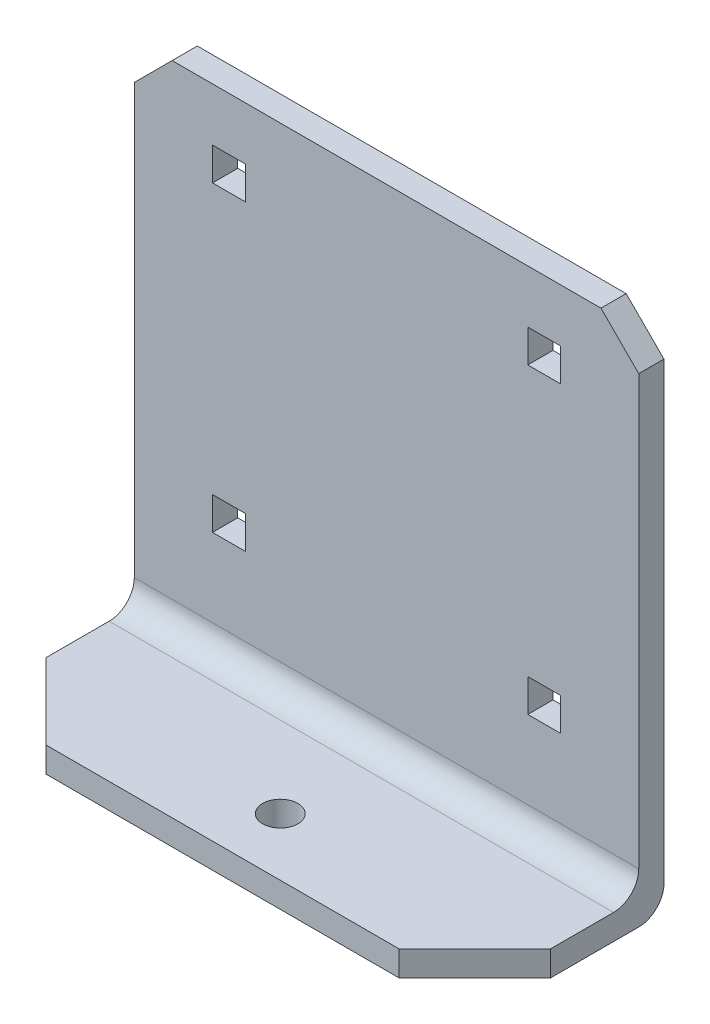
ISO-10303-21;
HEADER;
FILE_DESCRIPTION(('STEP AP214'),'2;1');
FILE_NAME('part.step','',(''),(''),'','','');
FILE_SCHEMA(('AUTOMOTIVE_DESIGN { 1 0 10303 214 1 1 1 1 }'));
ENDSEC;
DATA;
#1=APPLICATION_CONTEXT('core data for automotive mechanical design processes');
#2=APPLICATION_PROTOCOL_DEFINITION('international standard','automotive_design',2000,#1);
#3=PRODUCT_CONTEXT('',#1,'mechanical');
#4=PRODUCT('Part','Part','',(#3));
#5=PRODUCT_RELATED_PRODUCT_CATEGORY('part','',(#4));
#6=PRODUCT_DEFINITION_FORMATION('','',#4);
#7=PRODUCT_DEFINITION_CONTEXT('part definition',#1,'design');
#8=PRODUCT_DEFINITION('design','',#6,#7);
#9=PRODUCT_DEFINITION_SHAPE('','',#8);
#10=(LENGTH_UNIT() NAMED_UNIT(*) SI_UNIT(.MILLI.,.METRE.));
#11=(NAMED_UNIT(*) PLANE_ANGLE_UNIT() SI_UNIT($,.RADIAN.));
#12=(NAMED_UNIT(*) SI_UNIT($,.STERADIAN.) SOLID_ANGLE_UNIT());
#13=UNCERTAINTY_MEASURE_WITH_UNIT(LENGTH_MEASURE(1.E-05),#10,'distance_accuracy_value','');
#14=(GEOMETRIC_REPRESENTATION_CONTEXT(3) GLOBAL_UNCERTAINTY_ASSIGNED_CONTEXT((#13)) GLOBAL_UNIT_ASSIGNED_CONTEXT((#10,
#11,#12)) REPRESENTATION_CONTEXT('',''));
#15=CARTESIAN_POINT('',(0.,0.,0.));
#16=DIRECTION('',(0.,0.,1.));
#17=DIRECTION('',(1.,0.,0.));
#18=AXIS2_PLACEMENT_3D('',#15,#16,#17);
#19=CARTESIAN_POINT('',(100.,-107.5,10.));
#20=DIRECTION('',(0.,0.,1.));
#21=DIRECTION('',(1.,0.,0.));
#22=AXIS2_PLACEMENT_3D('',#19,#20,#21);
#23=PLANE('',#22);
#24=DIRECTION('',(0.,-1.,0.));
#25=VECTOR('',#24,1.);
#26=CARTESIAN_POINT('',(-100.,82.5,10.));
#27=LINE('',#26,#25);
#28=CARTESIAN_POINT('',(-100.,82.5,10.));
#29=VERTEX_POINT('',#28);
#30=CARTESIAN_POINT('',(-100.,-87.5,10.));
#31=VERTEX_POINT('',#30);
#32=EDGE_CURVE('E396',#29,#31,#27,.T.);
#33=ORIENTED_EDGE('',*,*,#32,.T.);
#34=DIRECTION('',(-1.,0.,0.));
#35=VECTOR('',#34,1.);
#36=CARTESIAN_POINT('',(100.,-87.5,10.));
#37=LINE('',#36,#35);
#38=CARTESIAN_POINT('',(100.,-87.5,10.));
#39=VERTEX_POINT('',#38);
#40=EDGE_CURVE('E377',#31,#39,#37,.F.);
#41=ORIENTED_EDGE('',*,*,#40,.T.);
#42=DIRECTION('',(0.,1.,0.));
#43=VECTOR('',#42,1.);
#44=CARTESIAN_POINT('',(99.9999999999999,82.5,10.));
#45=LINE('',#44,#43);
#46=CARTESIAN_POINT('',(99.9999999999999,82.5,10.));
#47=VERTEX_POINT('',#46);
#48=EDGE_CURVE('E367',#39,#47,#45,.T.);
#49=ORIENTED_EDGE('',*,*,#48,.T.);
#50=DIRECTION('',(-0.707106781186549,0.707106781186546,0.));
#51=VECTOR('',#50,1.);
#52=CARTESIAN_POINT('',(84.9999999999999,97.5,10.));
#53=LINE('',#52,#51);
#54=CARTESIAN_POINT('',(84.9999999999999,97.5,10.));
#55=VERTEX_POINT('',#54);
#56=EDGE_CURVE('E370',#47,#55,#53,.T.);
#57=ORIENTED_EDGE('',*,*,#56,.T.);
#58=DIRECTION('',(-1.,0.,0.));
#59=VECTOR('',#58,1.);
#60=CARTESIAN_POINT('',(-85.0000000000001,97.5,10.));
#61=LINE('',#60,#59);
#62=CARTESIAN_POINT('',(-85.0000000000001,97.5,10.));
#63=VERTEX_POINT('',#62);
#64=EDGE_CURVE('E500',#55,#63,#61,.T.);
#65=ORIENTED_EDGE('',*,*,#64,.T.);
#66=DIRECTION('',(-0.707106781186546,-0.707106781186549,0.));
#67=VECTOR('',#66,1.);
#68=CARTESIAN_POINT('',(-85.0000000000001,97.5,10.));
#69=LINE('',#68,#67);
#70=EDGE_CURVE('E531',#63,#29,#69,.T.);
#71=ORIENTED_EDGE('',*,*,#70,.T.);
#72=EDGE_LOOP('',(#33,#41,#49,#57,#65,#71));
#73=FACE_BOUND('',#72,.T.);
#74=DIRECTION('',(1.,0.,0.));
#75=VECTOR('',#74,1.);
#76=CARTESIAN_POINT('',(56.,-56.5,10.));
#77=LINE('',#76,#75);
#78=CARTESIAN_POINT('',(56.,-56.5,10.));
#79=VERTEX_POINT('',#78);
#80=CARTESIAN_POINT('',(69.,-56.5,10.));
#81=VERTEX_POINT('',#80);
#82=EDGE_CURVE('E277',#79,#81,#77,.T.);
#83=ORIENTED_EDGE('',*,*,#82,.F.);
#84=DIRECTION('',(0.,-1.,0.));
#85=VECTOR('',#84,1.);
#86=CARTESIAN_POINT('',(56.,-43.5,10.));
#87=LINE('',#86,#85);
#88=CARTESIAN_POINT('',(56.,-43.5,10.));
#89=VERTEX_POINT('',#88);
#90=EDGE_CURVE('E275',#89,#79,#87,.T.);
#91=ORIENTED_EDGE('',*,*,#90,.F.);
#92=DIRECTION('',(-1.,0.,0.));
#93=VECTOR('',#92,1.);
#94=CARTESIAN_POINT('',(56.,-43.5,10.));
#95=LINE('',#94,#93);
#96=CARTESIAN_POINT('',(69.,-43.5,10.));
#97=VERTEX_POINT('',#96);
#98=EDGE_CURVE('E282',#97,#89,#95,.T.);
#99=ORIENTED_EDGE('',*,*,#98,.F.);
#100=DIRECTION('',(0.,1.,0.));
#101=VECTOR('',#100,1.);
#102=CARTESIAN_POINT('',(69.,-43.5,10.));
#103=LINE('',#102,#101);
#104=EDGE_CURVE('E279',#81,#97,#103,.T.);
#105=ORIENTED_EDGE('',*,*,#104,.F.);
#106=EDGE_LOOP('',(#83,#91,#99,#105));
#107=FACE_BOUND('',#106,.T.);
#108=DIRECTION('',(1.,0.,0.));
#109=VECTOR('',#108,1.);
#110=CARTESIAN_POINT('',(-69.,63.5,10.));
#111=LINE('',#110,#109);
#112=CARTESIAN_POINT('',(-69.,63.5,10.));
#113=VERTEX_POINT('',#112);
#114=CARTESIAN_POINT('',(-56.,63.5,10.));
#115=VERTEX_POINT('',#114);
#116=EDGE_CURVE('E339',#113,#115,#111,.T.);
#117=ORIENTED_EDGE('',*,*,#116,.F.);
#118=DIRECTION('',(0.,-1.,0.));
#119=VECTOR('',#118,1.);
#120=CARTESIAN_POINT('',(-69.,76.5,10.));
#121=LINE('',#120,#119);
#122=CARTESIAN_POINT('',(-69.,76.5,10.));
#123=VERTEX_POINT('',#122);
#124=EDGE_CURVE('E337',#123,#113,#121,.T.);
#125=ORIENTED_EDGE('',*,*,#124,.F.);
#126=DIRECTION('',(-1.,0.,0.));
#127=VECTOR('',#126,1.);
#128=CARTESIAN_POINT('',(-69.,76.5,10.));
#129=LINE('',#128,#127);
#130=CARTESIAN_POINT('',(-56.,76.5,10.));
#131=VERTEX_POINT('',#130);
#132=EDGE_CURVE('E344',#131,#123,#129,.T.);
#133=ORIENTED_EDGE('',*,*,#132,.F.);
#134=DIRECTION('',(0.,1.,0.));
#135=VECTOR('',#134,1.);
#136=CARTESIAN_POINT('',(-56.,76.5,10.));
#137=LINE('',#136,#135);
#138=EDGE_CURVE('E341',#115,#131,#137,.T.);
#139=ORIENTED_EDGE('',*,*,#138,.F.);
#140=EDGE_LOOP('',(#117,#125,#133,#139));
#141=FACE_BOUND('',#140,.T.);
#142=DIRECTION('',(1.,0.,0.));
#143=VECTOR('',#142,1.);
#144=CARTESIAN_POINT('',(56.,63.5000000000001,10.));
#145=LINE('',#144,#143);
#146=CARTESIAN_POINT('',(56.,63.5000000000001,10.));
#147=VERTEX_POINT('',#146);
#148=CARTESIAN_POINT('',(69.,63.5000000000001,10.));
#149=VERTEX_POINT('',#148);
#150=EDGE_CURVE('E308',#147,#149,#145,.T.);
#151=ORIENTED_EDGE('',*,*,#150,.F.);
#152=DIRECTION('',(0.,-1.,0.));
#153=VECTOR('',#152,1.);
#154=CARTESIAN_POINT('',(56.,76.5000000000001,10.));
#155=LINE('',#154,#153);
#156=CARTESIAN_POINT('',(56.,76.5000000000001,10.));
#157=VERTEX_POINT('',#156);
#158=EDGE_CURVE('E306',#157,#147,#155,.T.);
#159=ORIENTED_EDGE('',*,*,#158,.F.);
#160=DIRECTION('',(-1.,0.,0.));
#161=VECTOR('',#160,1.);
#162=CARTESIAN_POINT('',(56.,76.5000000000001,10.));
#163=LINE('',#162,#161);
#164=CARTESIAN_POINT('',(69.,76.5000000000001,10.));
#165=VERTEX_POINT('',#164);
#166=EDGE_CURVE('E313',#165,#157,#163,.T.);
#167=ORIENTED_EDGE('',*,*,#166,.F.);
#168=DIRECTION('',(0.,1.,0.));
#169=VECTOR('',#168,1.);
#170=CARTESIAN_POINT('',(69.,76.5000000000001,10.));
#171=LINE('',#170,#169);
#172=EDGE_CURVE('E310',#149,#165,#171,.T.);
#173=ORIENTED_EDGE('',*,*,#172,.F.);
#174=EDGE_LOOP('',(#151,#159,#167,#173));
#175=FACE_BOUND('',#174,.T.);
#176=DIRECTION('',(1.,0.,0.));
#177=VECTOR('',#176,1.);
#178=CARTESIAN_POINT('',(-69.,-56.5,10.));
#179=LINE('',#178,#177);
#180=CARTESIAN_POINT('',(-69.,-56.5,10.));
#181=VERTEX_POINT('',#180);
#182=CARTESIAN_POINT('',(-56.,-56.5,10.));
#183=VERTEX_POINT('',#182);
#184=EDGE_CURVE('E252',#181,#183,#179,.T.);
#185=ORIENTED_EDGE('',*,*,#184,.F.);
#186=DIRECTION('',(0.,-1.,0.));
#187=VECTOR('',#186,1.);
#188=CARTESIAN_POINT('',(-69.,-43.5,10.));
#189=LINE('',#188,#187);
#190=CARTESIAN_POINT('',(-69.,-43.5,10.));
#191=VERTEX_POINT('',#190);
#192=EDGE_CURVE('E234',#191,#181,#189,.T.);
#193=ORIENTED_EDGE('',*,*,#192,.F.);
#194=DIRECTION('',(-1.,0.,0.));
#195=VECTOR('',#194,1.);
#196=CARTESIAN_POINT('',(-69.,-43.5,10.));
#197=LINE('',#196,#195);
#198=CARTESIAN_POINT('',(-56.,-43.5,10.));
#199=VERTEX_POINT('',#198);
#200=EDGE_CURVE('E257',#199,#191,#197,.T.);
#201=ORIENTED_EDGE('',*,*,#200,.F.);
#202=DIRECTION('',(0.,1.,0.));
#203=VECTOR('',#202,1.);
#204=CARTESIAN_POINT('',(-56.,-43.5,10.));
#205=LINE('',#204,#203);
#206=EDGE_CURVE('E254',#183,#199,#205,.T.);
#207=ORIENTED_EDGE('',*,*,#206,.F.);
#208=EDGE_LOOP('',(#185,#193,#201,#207));
#209=FACE_BOUND('',#208,.T.);
#210=ADVANCED_FACE('F32',(#73,#107,#141,#175,#209),#23,.T.);
#211=CARTESIAN_POINT('',(100.,-107.5,0.));
#212=DIRECTION('',(0.,0.,1.));
#213=DIRECTION('',(1.,0.,0.));
#214=AXIS2_PLACEMENT_3D('',#211,#212,#213);
#215=PLANE('',#214);
#216=DIRECTION('',(0.,-1.,0.));
#217=VECTOR('',#216,1.);
#218=CARTESIAN_POINT('',(56.,-43.5,0.));
#219=LINE('',#218,#217);
#220=CARTESIAN_POINT('',(56.,-43.5,0.));
#221=VERTEX_POINT('',#220);
#222=CARTESIAN_POINT('',(56.,-56.5,0.));
#223=VERTEX_POINT('',#222);
#224=EDGE_CURVE('E235',#221,#223,#219,.T.);
#225=ORIENTED_EDGE('',*,*,#224,.T.);
#226=DIRECTION('',(1.,0.,0.));
#227=VECTOR('',#226,1.);
#228=CARTESIAN_POINT('',(56.,-56.5,0.));
#229=LINE('',#228,#227);
#230=CARTESIAN_POINT('',(69.,-56.5,0.));
#231=VERTEX_POINT('',#230);
#232=EDGE_CURVE('E266',#223,#231,#229,.T.);
#233=ORIENTED_EDGE('',*,*,#232,.T.);
#234=DIRECTION('',(0.,1.,0.));
#235=VECTOR('',#234,1.);
#236=CARTESIAN_POINT('',(69.,-43.5,0.));
#237=LINE('',#236,#235);
#238=CARTESIAN_POINT('',(69.,-43.5,0.));
#239=VERTEX_POINT('',#238);
#240=EDGE_CURVE('E269',#231,#239,#237,.T.);
#241=ORIENTED_EDGE('',*,*,#240,.T.);
#242=DIRECTION('',(-1.,0.,0.));
#243=VECTOR('',#242,1.);
#244=CARTESIAN_POINT('',(56.,-43.5,0.));
#245=LINE('',#244,#243);
#246=EDGE_CURVE('E272',#239,#221,#245,.T.);
#247=ORIENTED_EDGE('',*,*,#246,.T.);
#248=EDGE_LOOP('',(#225,#233,#241,#247));
#249=FACE_BOUND('',#248,.T.);
#250=DIRECTION('',(0.,-1.,0.));
#251=VECTOR('',#250,1.);
#252=CARTESIAN_POINT('',(-69.,76.5,0.));
#253=LINE('',#252,#251);
#254=CARTESIAN_POINT('',(-69.,76.5,0.));
#255=VERTEX_POINT('',#254);
#256=CARTESIAN_POINT('',(-69.,63.5,0.));
#257=VERTEX_POINT('',#256);
#258=EDGE_CURVE('E325',#255,#257,#253,.T.);
#259=ORIENTED_EDGE('',*,*,#258,.T.);
#260=DIRECTION('',(1.,0.,0.));
#261=VECTOR('',#260,1.);
#262=CARTESIAN_POINT('',(-69.,63.5,0.));
#263=LINE('',#262,#261);
#264=CARTESIAN_POINT('',(-56.,63.5,0.));
#265=VERTEX_POINT('',#264);
#266=EDGE_CURVE('E328',#257,#265,#263,.T.);
#267=ORIENTED_EDGE('',*,*,#266,.T.);
#268=DIRECTION('',(0.,1.,0.));
#269=VECTOR('',#268,1.);
#270=CARTESIAN_POINT('',(-56.,76.5,0.));
#271=LINE('',#270,#269);
#272=CARTESIAN_POINT('',(-56.,76.5,0.));
#273=VERTEX_POINT('',#272);
#274=EDGE_CURVE('E331',#265,#273,#271,.T.);
#275=ORIENTED_EDGE('',*,*,#274,.T.);
#276=DIRECTION('',(-1.,0.,0.));
#277=VECTOR('',#276,1.);
#278=CARTESIAN_POINT('',(-69.,76.5,0.));
#279=LINE('',#278,#277);
#280=EDGE_CURVE('E334',#273,#255,#279,.T.);
#281=ORIENTED_EDGE('',*,*,#280,.T.);
#282=EDGE_LOOP('',(#259,#267,#275,#281));
#283=FACE_BOUND('',#282,.T.);
#284=DIRECTION('',(0.,1.,0.));
#285=VECTOR('',#284,1.);
#286=CARTESIAN_POINT('',(99.9999999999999,82.5,0.));
#287=LINE('',#286,#285);
#288=CARTESIAN_POINT('',(100.,-97.5,0.));
#289=VERTEX_POINT('',#288);
#290=CARTESIAN_POINT('',(99.9999999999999,82.5,0.));
#291=VERTEX_POINT('',#290);
#292=EDGE_CURVE('E356',#289,#291,#287,.T.);
#293=ORIENTED_EDGE('',*,*,#292,.F.);
#294=DIRECTION('',(1.,0.,0.));
#295=VECTOR('',#294,1.);
#296=CARTESIAN_POINT('',(100.,-97.5,0.));
#297=LINE('',#296,#295);
#298=CARTESIAN_POINT('',(-100.,-97.5,0.));
#299=VERTEX_POINT('',#298);
#300=EDGE_CURVE('E520',#289,#299,#297,.F.);
#301=ORIENTED_EDGE('',*,*,#300,.T.);
#302=DIRECTION('',(0.,-1.,0.));
#303=VECTOR('',#302,1.);
#304=CARTESIAN_POINT('',(-100.,82.5,0.));
#305=LINE('',#304,#303);
#306=CARTESIAN_POINT('',(-100.,82.5,0.));
#307=VERTEX_POINT('',#306);
#308=EDGE_CURVE('E364',#307,#299,#305,.T.);
#309=ORIENTED_EDGE('',*,*,#308,.F.);
#310=DIRECTION('',(-0.707106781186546,-0.707106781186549,0.));
#311=VECTOR('',#310,1.);
#312=CARTESIAN_POINT('',(-85.0000000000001,97.5,0.));
#313=LINE('',#312,#311);
#314=CARTESIAN_POINT('',(-85.0000000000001,97.5,0.));
#315=VERTEX_POINT('',#314);
#316=EDGE_CURVE('E362',#315,#307,#313,.T.);
#317=ORIENTED_EDGE('',*,*,#316,.F.);
#318=DIRECTION('',(-1.,0.,0.));
#319=VECTOR('',#318,1.);
#320=CARTESIAN_POINT('',(-85.0000000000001,97.5,0.));
#321=LINE('',#320,#319);
#322=CARTESIAN_POINT('',(84.9999999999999,97.5,0.));
#323=VERTEX_POINT('',#322);
#324=EDGE_CURVE('E360',#323,#315,#321,.T.);
#325=ORIENTED_EDGE('',*,*,#324,.F.);
#326=DIRECTION('',(-0.707106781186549,0.707106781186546,0.));
#327=VECTOR('',#326,1.);
#328=CARTESIAN_POINT('',(84.9999999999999,97.5,0.));
#329=LINE('',#328,#327);
#330=EDGE_CURVE('E358',#291,#323,#329,.T.);
#331=ORIENTED_EDGE('',*,*,#330,.F.);
#332=EDGE_LOOP('',(#293,#301,#309,#317,#325,#331));
#333=FACE_BOUND('',#332,.T.);
#334=DIRECTION('',(0.,-1.,0.));
#335=VECTOR('',#334,1.);
#336=CARTESIAN_POINT('',(56.,76.5000000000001,0.));
#337=LINE('',#336,#335);
#338=CARTESIAN_POINT('',(56.,76.5000000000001,0.));
#339=VERTEX_POINT('',#338);
#340=CARTESIAN_POINT('',(56.,63.5000000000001,0.));
#341=VERTEX_POINT('',#340);
#342=EDGE_CURVE('E294',#339,#341,#337,.T.);
#343=ORIENTED_EDGE('',*,*,#342,.T.);
#344=DIRECTION('',(1.,0.,0.));
#345=VECTOR('',#344,1.);
#346=CARTESIAN_POINT('',(56.,63.5000000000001,0.));
#347=LINE('',#346,#345);
#348=CARTESIAN_POINT('',(69.,63.5000000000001,0.));
#349=VERTEX_POINT('',#348);
#350=EDGE_CURVE('E297',#341,#349,#347,.T.);
#351=ORIENTED_EDGE('',*,*,#350,.T.);
#352=DIRECTION('',(0.,1.,0.));
#353=VECTOR('',#352,1.);
#354=CARTESIAN_POINT('',(69.,76.5000000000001,0.));
#355=LINE('',#354,#353);
#356=CARTESIAN_POINT('',(69.,76.5000000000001,0.));
#357=VERTEX_POINT('',#356);
#358=EDGE_CURVE('E300',#349,#357,#355,.T.);
#359=ORIENTED_EDGE('',*,*,#358,.T.);
#360=DIRECTION('',(-1.,0.,0.));
#361=VECTOR('',#360,1.);
#362=CARTESIAN_POINT('',(56.,76.5000000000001,0.));
#363=LINE('',#362,#361);
#364=EDGE_CURVE('E303',#357,#339,#363,.T.);
#365=ORIENTED_EDGE('',*,*,#364,.T.);
#366=EDGE_LOOP('',(#343,#351,#359,#365));
#367=FACE_BOUND('',#366,.T.);
#368=DIRECTION('',(0.,-1.,0.));
#369=VECTOR('',#368,1.);
#370=CARTESIAN_POINT('',(-69.,-43.5,0.));
#371=LINE('',#370,#369);
#372=CARTESIAN_POINT('',(-69.,-43.5,0.));
#373=VERTEX_POINT('',#372);
#374=CARTESIAN_POINT('',(-69.,-56.5,0.));
#375=VERTEX_POINT('',#374);
#376=EDGE_CURVE('E227',#373,#375,#371,.T.);
#377=ORIENTED_EDGE('',*,*,#376,.T.);
#378=DIRECTION('',(1.,0.,0.));
#379=VECTOR('',#378,1.);
#380=CARTESIAN_POINT('',(-69.,-56.5,0.));
#381=LINE('',#380,#379);
#382=CARTESIAN_POINT('',(-56.,-56.5,0.));
#383=VERTEX_POINT('',#382);
#384=EDGE_CURVE('E215',#375,#383,#381,.T.);
#385=ORIENTED_EDGE('',*,*,#384,.T.);
#386=DIRECTION('',(0.,1.,0.));
#387=VECTOR('',#386,1.);
#388=CARTESIAN_POINT('',(-56.,-43.5,0.));
#389=LINE('',#388,#387);
#390=CARTESIAN_POINT('',(-56.,-43.5,0.));
#391=VERTEX_POINT('',#390);
#392=EDGE_CURVE('E226',#383,#391,#389,.T.);
#393=ORIENTED_EDGE('',*,*,#392,.T.);
#394=DIRECTION('',(-1.,0.,0.));
#395=VECTOR('',#394,1.);
#396=CARTESIAN_POINT('',(-69.,-43.5,0.));
#397=LINE('',#396,#395);
#398=EDGE_CURVE('E240',#391,#373,#397,.T.);
#399=ORIENTED_EDGE('',*,*,#398,.T.);
#400=EDGE_LOOP('',(#377,#385,#393,#399));
#401=FACE_BOUND('',#400,.T.);
#402=ADVANCED_FACE('F238',(#249,#283,#333,#367,#401),#215,.F.);
#403=CARTESIAN_POINT('',(99.9999999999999,82.5,10.));
#404=DIRECTION('',(-1.,0.,0.));
#405=DIRECTION('',(0.,-1.,0.));
#406=AXIS2_PLACEMENT_3D('',#403,#404,#405);
#407=PLANE('',#406);
#408=DIRECTION('',(0.,0.,-1.));
#409=VECTOR('',#408,1.);
#410=CARTESIAN_POINT('',(100.,-97.5,75.));
#411=LINE('',#410,#409);
#412=CARTESIAN_POINT('',(100.,-97.5,44.9999999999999));
#413=VERTEX_POINT('',#412);
#414=CARTESIAN_POINT('',(100.,-97.5,20.));
#415=VERTEX_POINT('',#414);
#416=EDGE_CURVE('E241',#413,#415,#411,.T.);
#417=ORIENTED_EDGE('',*,*,#416,.F.);
#418=DIRECTION('',(0.,-1.,0.));
#419=VECTOR('',#418,1.);
#420=CARTESIAN_POINT('',(100.,-107.5,44.9999999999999));
#421=LINE('',#420,#419);
#422=CARTESIAN_POINT('',(100.,-107.5,44.9999999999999));
#423=VERTEX_POINT('',#422);
#424=EDGE_CURVE('E40',#413,#423,#421,.T.);
#425=ORIENTED_EDGE('',*,*,#424,.T.);
#426=DIRECTION('',(0.,0.,-1.));
#427=VECTOR('',#426,1.);
#428=CARTESIAN_POINT('',(100.,-107.5,10.));
#429=LINE('',#428,#427);
#430=CARTESIAN_POINT('',(100.,-107.5,10.));
#431=VERTEX_POINT('',#430);
#432=EDGE_CURVE('E514',#423,#431,#429,.T.);
#433=ORIENTED_EDGE('',*,*,#432,.T.);
#434=CARTESIAN_POINT('',(100.,-97.5,10.));
#435=DIRECTION('',(-1.,0.,0.));
#436=DIRECTION('',(0.,-1.,0.));
#437=AXIS2_PLACEMENT_3D('',#434,#435,#436);
#438=CIRCLE('',#437,10.);
#439=EDGE_CURVE('E518',#431,#289,#438,.F.);
#440=ORIENTED_EDGE('',*,*,#439,.T.);
#441=ORIENTED_EDGE('',*,*,#292,.T.);
#442=DIRECTION('',(0.,0.,-1.));
#443=VECTOR('',#442,1.);
#444=CARTESIAN_POINT('',(99.9999999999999,82.5,10.));
#445=LINE('',#444,#443);
#446=EDGE_CURVE('E494',#47,#291,#445,.T.);
#447=ORIENTED_EDGE('',*,*,#446,.F.);
#448=ORIENTED_EDGE('',*,*,#48,.F.);
#449=CARTESIAN_POINT('',(100.,-87.5,20.));
#450=DIRECTION('',(-1.,0.,0.));
#451=DIRECTION('',(0.,-1.,0.));
#452=AXIS2_PLACEMENT_3D('',#449,#450,#451);
#453=CIRCLE('',#452,10.);
#454=EDGE_CURVE('E381',#39,#415,#453,.T.);
#455=ORIENTED_EDGE('',*,*,#454,.T.);
#456=EDGE_LOOP('',(#417,#425,#433,#440,#441,#447,#448,#455));
#457=FACE_BOUND('',#456,.T.);
#458=ADVANCED_FACE('F34',(#457),#407,.F.);
#459=CARTESIAN_POINT('',(84.9999999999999,97.5,10.));
#460=DIRECTION('',(-0.707106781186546,-0.707106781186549,0.));
#461=DIRECTION('',(0.707106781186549,-0.707106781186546,0.));
#462=AXIS2_PLACEMENT_3D('',#459,#460,#461);
#463=PLANE('',#462);
#464=ORIENTED_EDGE('',*,*,#330,.T.);
#465=DIRECTION('',(0.,0.,-1.));
#466=VECTOR('',#465,1.);
#467=CARTESIAN_POINT('',(84.9999999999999,97.5,10.));
#468=LINE('',#467,#466);
#469=EDGE_CURVE('E491',#55,#323,#468,.T.);
#470=ORIENTED_EDGE('',*,*,#469,.F.);
#471=ORIENTED_EDGE('',*,*,#56,.F.);
#472=ORIENTED_EDGE('',*,*,#446,.T.);
#473=EDGE_LOOP('',(#464,#470,#471,#472));
#474=FACE_BOUND('',#473,.T.);
#475=ADVANCED_FACE('F479',(#474),#463,.F.);
#476=CARTESIAN_POINT('',(-85.0000000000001,97.5,10.));
#477=DIRECTION('',(0.,-1.,0.));
#478=DIRECTION('',(0.,0.,-1.));
#479=AXIS2_PLACEMENT_3D('',#476,#477,#478);
#480=PLANE('',#479);
#481=ORIENTED_EDGE('',*,*,#324,.T.);
#482=DIRECTION('',(0.,0.,-1.));
#483=VECTOR('',#482,1.);
#484=CARTESIAN_POINT('',(-85.0000000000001,97.5,10.));
#485=LINE('',#484,#483);
#486=EDGE_CURVE('E501',#63,#315,#485,.T.);
#487=ORIENTED_EDGE('',*,*,#486,.F.);
#488=ORIENTED_EDGE('',*,*,#64,.F.);
#489=ORIENTED_EDGE('',*,*,#469,.T.);
#490=EDGE_LOOP('',(#481,#487,#488,#489));
#491=FACE_BOUND('',#490,.T.);
#492=ADVANCED_FACE('F476',(#491),#480,.F.);
#493=CARTESIAN_POINT('',(-85.0000000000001,97.5,10.));
#494=DIRECTION('',(0.707106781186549,-0.707106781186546,0.));
#495=DIRECTION('',(0.707106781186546,0.707106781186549,0.));
#496=AXIS2_PLACEMENT_3D('',#493,#494,#495);
#497=PLANE('',#496);
#498=ORIENTED_EDGE('',*,*,#316,.T.);
#499=DIRECTION('',(0.,0.,-1.));
#500=VECTOR('',#499,1.);
#501=CARTESIAN_POINT('',(-100.,82.5,10.));
#502=LINE('',#501,#500);
#503=EDGE_CURVE('E509',#29,#307,#502,.T.);
#504=ORIENTED_EDGE('',*,*,#503,.F.);
#505=ORIENTED_EDGE('',*,*,#70,.F.);
#506=ORIENTED_EDGE('',*,*,#486,.T.);
#507=EDGE_LOOP('',(#498,#504,#505,#506));
#508=FACE_BOUND('',#507,.T.);
#509=ADVANCED_FACE('F473',(#508),#497,.F.);
#510=CARTESIAN_POINT('',(-100.,82.5,10.));
#511=DIRECTION('',(1.,0.,0.));
#512=DIRECTION('',(0.,1.,0.));
#513=AXIS2_PLACEMENT_3D('',#510,#511,#512);
#514=PLANE('',#513);
#515=DIRECTION('',(0.,0.,-1.));
#516=VECTOR('',#515,1.);
#517=CARTESIAN_POINT('',(-100.,-107.5,10.));
#518=LINE('',#517,#516);
#519=CARTESIAN_POINT('',(-100.,-107.5,44.9999999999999));
#520=VERTEX_POINT('',#519);
#521=CARTESIAN_POINT('',(-100.,-107.5,10.));
#522=VERTEX_POINT('',#521);
#523=EDGE_CURVE('E421',#520,#522,#518,.T.);
#524=ORIENTED_EDGE('',*,*,#523,.F.);
#525=DIRECTION('',(0.,1.,0.));
#526=VECTOR('',#525,1.);
#527=CARTESIAN_POINT('',(-100.,-97.5,44.9999999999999));
#528=LINE('',#527,#526);
#529=CARTESIAN_POINT('',(-100.,-97.5,44.9999999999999));
#530=VERTEX_POINT('',#529);
#531=EDGE_CURVE('E389',#520,#530,#528,.T.);
#532=ORIENTED_EDGE('',*,*,#531,.T.);
#533=DIRECTION('',(0.,0.,-1.));
#534=VECTOR('',#533,1.);
#535=CARTESIAN_POINT('',(-100.,-97.5,75.));
#536=LINE('',#535,#534);
#537=CARTESIAN_POINT('',(-100.,-97.5,20.));
#538=VERTEX_POINT('',#537);
#539=EDGE_CURVE('E243',#530,#538,#536,.T.);
#540=ORIENTED_EDGE('',*,*,#539,.T.);
#541=CARTESIAN_POINT('',(-100.,-87.5,20.));
#542=DIRECTION('',(1.,0.,0.));
#543=DIRECTION('',(0.,1.,0.));
#544=AXIS2_PLACEMENT_3D('',#541,#542,#543);
#545=CIRCLE('',#544,10.);
#546=EDGE_CURVE('E379',#538,#31,#545,.T.);
#547=ORIENTED_EDGE('',*,*,#546,.T.);
#548=ORIENTED_EDGE('',*,*,#32,.F.);
#549=ORIENTED_EDGE('',*,*,#503,.T.);
#550=ORIENTED_EDGE('',*,*,#308,.T.);
#551=CARTESIAN_POINT('',(-100.,-97.5,10.));
#552=DIRECTION('',(1.,0.,0.));
#553=DIRECTION('',(0.,1.,0.));
#554=AXIS2_PLACEMENT_3D('',#551,#552,#553);
#555=CIRCLE('',#554,10.);
#556=EDGE_CURVE('E522',#299,#522,#555,.F.);
#557=ORIENTED_EDGE('',*,*,#556,.T.);
#558=EDGE_LOOP('',(#524,#532,#540,#547,#548,#549,#550,#557));
#559=FACE_BOUND('',#558,.T.);
#560=ADVANCED_FACE('F418',(#559),#514,.F.);
#561=CARTESIAN_POINT('',(-100.,-107.5,10.));
#562=DIRECTION('',(0.,1.,0.));
#563=DIRECTION('',(0.,0.,1.));
#564=AXIS2_PLACEMENT_3D('',#561,#562,#563);
#565=PLANE('',#564);
#566=CARTESIAN_POINT('',(0.,-107.5,52.1321216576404));
#567=DIRECTION('',(0.,1.,0.));
#568=DIRECTION('',(0.,0.,1.));
#569=AXIS2_PLACEMENT_3D('',#566,#567,#568);
#570=CIRCLE('',#569,7.);
#571=CARTESIAN_POINT('',(0.,-107.5,59.1321216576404));
#572=VERTEX_POINT('',#571);
#573=EDGE_CURVE('E433',#572,#572,#570,.T.);
#574=ORIENTED_EDGE('',*,*,#573,.T.);
#575=EDGE_LOOP('',(#574));
#576=FACE_BOUND('',#575,.T.);
#577=ORIENTED_EDGE('',*,*,#432,.F.);
#578=DIRECTION('',(-0.707106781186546,0.,0.707106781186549));
#579=VECTOR('',#578,1.);
#580=CARTESIAN_POINT('',(70.,-107.5,75.));
#581=LINE('',#580,#579);
#582=CARTESIAN_POINT('',(70.,-107.5,75.));
#583=VERTEX_POINT('',#582);
#584=EDGE_CURVE('E12',#423,#583,#581,.T.);
#585=ORIENTED_EDGE('',*,*,#584,.T.);
#586=DIRECTION('',(1.,0.,0.));
#587=VECTOR('',#586,1.);
#588=CARTESIAN_POINT('',(-100.,-107.5,75.));
#589=LINE('',#588,#587);
#590=CARTESIAN_POINT('',(-70.,-107.5,75.));
#591=VERTEX_POINT('',#590);
#592=EDGE_CURVE('E429',#591,#583,#589,.T.);
#593=ORIENTED_EDGE('',*,*,#592,.F.);
#594=DIRECTION('',(-0.707106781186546,0.,-0.707106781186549));
#595=VECTOR('',#594,1.);
#596=CARTESIAN_POINT('',(-70.,-107.5,75.));
#597=LINE('',#596,#595);
#598=EDGE_CURVE('E387',#591,#520,#597,.T.);
#599=ORIENTED_EDGE('',*,*,#598,.T.);
#600=ORIENTED_EDGE('',*,*,#523,.T.);
#601=DIRECTION('',(1.,0.,0.));
#602=VECTOR('',#601,1.);
#603=CARTESIAN_POINT('',(-100.,-107.5,10.));
#604=LINE('',#603,#602);
#605=EDGE_CURVE('E401',#522,#431,#604,.T.);
#606=ORIENTED_EDGE('',*,*,#605,.T.);
#607=EDGE_LOOP('',(#577,#585,#593,#599,#600,#606));
#608=FACE_BOUND('',#607,.T.);
#609=ADVANCED_FACE('F431',(#576,#608),#565,.F.);
#610=CARTESIAN_POINT('',(-69.,76.5,10.));
#611=DIRECTION('',(1.,0.,0.));
#612=DIRECTION('',(0.,0.,-1.));
#613=AXIS2_PLACEMENT_3D('',#610,#611,#612);
#614=PLANE('',#613);
#615=ORIENTED_EDGE('',*,*,#258,.F.);
#616=DIRECTION('',(0.,0.,-1.));
#617=VECTOR('',#616,1.);
#618=CARTESIAN_POINT('',(-69.,76.5,10.));
#619=LINE('',#618,#617);
#620=EDGE_CURVE('E346',#123,#255,#619,.T.);
#621=ORIENTED_EDGE('',*,*,#620,.F.);
#622=ORIENTED_EDGE('',*,*,#124,.T.);
#623=DIRECTION('',(0.,0.,-1.));
#624=VECTOR('',#623,1.);
#625=CARTESIAN_POINT('',(-69.,63.5,10.));
#626=LINE('',#625,#624);
#627=EDGE_CURVE('E353',#113,#257,#626,.T.);
#628=ORIENTED_EDGE('',*,*,#627,.T.);
#629=EDGE_LOOP('',(#615,#621,#622,#628));
#630=FACE_BOUND('',#629,.T.);
#631=ADVANCED_FACE('F469',(#630),#614,.T.);
#632=CARTESIAN_POINT('',(-69.,63.5,10.));
#633=DIRECTION('',(0.,1.,0.));
#634=DIRECTION('',(0.,0.,1.));
#635=AXIS2_PLACEMENT_3D('',#632,#633,#634);
#636=PLANE('',#635);
#637=ORIENTED_EDGE('',*,*,#266,.F.);
#638=ORIENTED_EDGE('',*,*,#627,.F.);
#639=ORIENTED_EDGE('',*,*,#116,.T.);
#640=DIRECTION('',(0.,0.,-1.));
#641=VECTOR('',#640,1.);
#642=CARTESIAN_POINT('',(-56.,63.5,10.));
#643=LINE('',#642,#641);
#644=EDGE_CURVE('E351',#115,#265,#643,.T.);
#645=ORIENTED_EDGE('',*,*,#644,.T.);
#646=EDGE_LOOP('',(#637,#638,#639,#645));
#647=FACE_BOUND('',#646,.T.);
#648=ADVANCED_FACE('F733',(#647),#636,.T.);
#649=CARTESIAN_POINT('',(-56.,76.5,10.));
#650=DIRECTION('',(-1.,0.,0.));
#651=DIRECTION('',(0.,0.,1.));
#652=AXIS2_PLACEMENT_3D('',#649,#650,#651);
#653=PLANE('',#652);
#654=ORIENTED_EDGE('',*,*,#274,.F.);
#655=ORIENTED_EDGE('',*,*,#644,.F.);
#656=ORIENTED_EDGE('',*,*,#138,.T.);
#657=DIRECTION('',(0.,0.,-1.));
#658=VECTOR('',#657,1.);
#659=CARTESIAN_POINT('',(-56.,76.5,10.));
#660=LINE('',#659,#658);
#661=EDGE_CURVE('E349',#131,#273,#660,.T.);
#662=ORIENTED_EDGE('',*,*,#661,.T.);
#663=EDGE_LOOP('',(#654,#655,#656,#662));
#664=FACE_BOUND('',#663,.T.);
#665=ADVANCED_FACE('F724',(#664),#653,.T.);
#666=CARTESIAN_POINT('',(-69.,76.5,10.));
#667=DIRECTION('',(0.,-1.,0.));
#668=DIRECTION('',(0.,0.,-1.));
#669=AXIS2_PLACEMENT_3D('',#666,#667,#668);
#670=PLANE('',#669);
#671=ORIENTED_EDGE('',*,*,#280,.F.);
#672=ORIENTED_EDGE('',*,*,#661,.F.);
#673=ORIENTED_EDGE('',*,*,#132,.T.);
#674=ORIENTED_EDGE('',*,*,#620,.T.);
#675=EDGE_LOOP('',(#671,#672,#673,#674));
#676=FACE_BOUND('',#675,.T.);
#677=ADVANCED_FACE('F715',(#676),#670,.T.);
#678=CARTESIAN_POINT('',(56.,76.5000000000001,10.));
#679=DIRECTION('',(1.,0.,0.));
#680=DIRECTION('',(0.,0.,-1.));
#681=AXIS2_PLACEMENT_3D('',#678,#679,#680);
#682=PLANE('',#681);
#683=ORIENTED_EDGE('',*,*,#342,.F.);
#684=DIRECTION('',(0.,0.,-1.));
#685=VECTOR('',#684,1.);
#686=CARTESIAN_POINT('',(56.,76.5000000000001,10.));
#687=LINE('',#686,#685);
#688=EDGE_CURVE('E315',#157,#339,#687,.T.);
#689=ORIENTED_EDGE('',*,*,#688,.F.);
#690=ORIENTED_EDGE('',*,*,#158,.T.);
#691=DIRECTION('',(0.,0.,-1.));
#692=VECTOR('',#691,1.);
#693=CARTESIAN_POINT('',(56.,63.5000000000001,10.));
#694=LINE('',#693,#692);
#695=EDGE_CURVE('E322',#147,#341,#694,.T.);
#696=ORIENTED_EDGE('',*,*,#695,.T.);
#697=EDGE_LOOP('',(#683,#689,#690,#696));
#698=FACE_BOUND('',#697,.T.);
#699=ADVANCED_FACE('F706',(#698),#682,.T.);
#700=CARTESIAN_POINT('',(56.,63.5000000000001,10.));
#701=DIRECTION('',(0.,1.,0.));
#702=DIRECTION('',(0.,0.,1.));
#703=AXIS2_PLACEMENT_3D('',#700,#701,#702);
#704=PLANE('',#703);
#705=ORIENTED_EDGE('',*,*,#350,.F.);
#706=ORIENTED_EDGE('',*,*,#695,.F.);
#707=ORIENTED_EDGE('',*,*,#150,.T.);
#708=DIRECTION('',(0.,0.,-1.));
#709=VECTOR('',#708,1.);
#710=CARTESIAN_POINT('',(69.,63.5000000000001,10.));
#711=LINE('',#710,#709);
#712=EDGE_CURVE('E320',#149,#349,#711,.T.);
#713=ORIENTED_EDGE('',*,*,#712,.T.);
#714=EDGE_LOOP('',(#705,#706,#707,#713));
#715=FACE_BOUND('',#714,.T.);
#716=ADVANCED_FACE('F697',(#715),#704,.T.);
#717=CARTESIAN_POINT('',(69.,76.5000000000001,10.));
#718=DIRECTION('',(-1.,0.,0.));
#719=DIRECTION('',(0.,0.,1.));
#720=AXIS2_PLACEMENT_3D('',#717,#718,#719);
#721=PLANE('',#720);
#722=ORIENTED_EDGE('',*,*,#358,.F.);
#723=ORIENTED_EDGE('',*,*,#712,.F.);
#724=ORIENTED_EDGE('',*,*,#172,.T.);
#725=DIRECTION('',(0.,0.,-1.));
#726=VECTOR('',#725,1.);
#727=CARTESIAN_POINT('',(69.,76.5000000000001,10.));
#728=LINE('',#727,#726);
#729=EDGE_CURVE('E318',#165,#357,#728,.T.);
#730=ORIENTED_EDGE('',*,*,#729,.T.);
#731=EDGE_LOOP('',(#722,#723,#724,#730));
#732=FACE_BOUND('',#731,.T.);
#733=ADVANCED_FACE('F688',(#732),#721,.T.);
#734=CARTESIAN_POINT('',(56.,76.5000000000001,10.));
#735=DIRECTION('',(0.,-1.,0.));
#736=DIRECTION('',(0.,0.,-1.));
#737=AXIS2_PLACEMENT_3D('',#734,#735,#736);
#738=PLANE('',#737);
#739=ORIENTED_EDGE('',*,*,#364,.F.);
#740=ORIENTED_EDGE('',*,*,#729,.F.);
#741=ORIENTED_EDGE('',*,*,#166,.T.);
#742=ORIENTED_EDGE('',*,*,#688,.T.);
#743=EDGE_LOOP('',(#739,#740,#741,#742));
#744=FACE_BOUND('',#743,.T.);
#745=ADVANCED_FACE('F679',(#744),#738,.T.);
#746=CARTESIAN_POINT('',(56.,-43.5,10.));
#747=DIRECTION('',(1.,0.,0.));
#748=DIRECTION('',(0.,0.,-1.));
#749=AXIS2_PLACEMENT_3D('',#746,#747,#748);
#750=PLANE('',#749);
#751=ORIENTED_EDGE('',*,*,#224,.F.);
#752=DIRECTION('',(0.,0.,-1.));
#753=VECTOR('',#752,1.);
#754=CARTESIAN_POINT('',(56.,-43.5,10.));
#755=LINE('',#754,#753);
#756=EDGE_CURVE('E284',#89,#221,#755,.T.);
#757=ORIENTED_EDGE('',*,*,#756,.F.);
#758=ORIENTED_EDGE('',*,*,#90,.T.);
#759=DIRECTION('',(0.,0.,-1.));
#760=VECTOR('',#759,1.);
#761=CARTESIAN_POINT('',(56.,-56.5,10.));
#762=LINE('',#761,#760);
#763=EDGE_CURVE('E291',#79,#223,#762,.T.);
#764=ORIENTED_EDGE('',*,*,#763,.T.);
#765=EDGE_LOOP('',(#751,#757,#758,#764));
#766=FACE_BOUND('',#765,.T.);
#767=ADVANCED_FACE('F670',(#766),#750,.T.);
#768=CARTESIAN_POINT('',(56.,-56.5,10.));
#769=DIRECTION('',(0.,1.,0.));
#770=DIRECTION('',(-1.,0.,0.));
#771=AXIS2_PLACEMENT_3D('',#768,#769,#770);
#772=PLANE('',#771);
#773=ORIENTED_EDGE('',*,*,#232,.F.);
#774=ORIENTED_EDGE('',*,*,#763,.F.);
#775=ORIENTED_EDGE('',*,*,#82,.T.);
#776=DIRECTION('',(0.,0.,-1.));
#777=VECTOR('',#776,1.);
#778=CARTESIAN_POINT('',(69.,-56.5,10.));
#779=LINE('',#778,#777);
#780=EDGE_CURVE('E289',#81,#231,#779,.T.);
#781=ORIENTED_EDGE('',*,*,#780,.T.);
#782=EDGE_LOOP('',(#773,#774,#775,#781));
#783=FACE_BOUND('',#782,.T.);
#784=ADVANCED_FACE('F661',(#783),#772,.T.);
#785=CARTESIAN_POINT('',(69.,-43.5,10.));
#786=DIRECTION('',(-1.,0.,0.));
#787=DIRECTION('',(0.,0.,1.));
#788=AXIS2_PLACEMENT_3D('',#785,#786,#787);
#789=PLANE('',#788);
#790=ORIENTED_EDGE('',*,*,#240,.F.);
#791=ORIENTED_EDGE('',*,*,#780,.F.);
#792=ORIENTED_EDGE('',*,*,#104,.T.);
#793=DIRECTION('',(0.,0.,-1.));
#794=VECTOR('',#793,1.);
#795=CARTESIAN_POINT('',(69.,-43.5,10.));
#796=LINE('',#795,#794);
#797=EDGE_CURVE('E287',#97,#239,#796,.T.);
#798=ORIENTED_EDGE('',*,*,#797,.T.);
#799=EDGE_LOOP('',(#790,#791,#792,#798));
#800=FACE_BOUND('',#799,.T.);
#801=ADVANCED_FACE('F652',(#800),#789,.T.);
#802=CARTESIAN_POINT('',(56.,-43.5,10.));
#803=DIRECTION('',(0.,-1.,0.));
#804=DIRECTION('',(0.,0.,-1.));
#805=AXIS2_PLACEMENT_3D('',#802,#803,#804);
#806=PLANE('',#805);
#807=ORIENTED_EDGE('',*,*,#246,.F.);
#808=ORIENTED_EDGE('',*,*,#797,.F.);
#809=ORIENTED_EDGE('',*,*,#98,.T.);
#810=ORIENTED_EDGE('',*,*,#756,.T.);
#811=EDGE_LOOP('',(#807,#808,#809,#810));
#812=FACE_BOUND('',#811,.T.);
#813=ADVANCED_FACE('F644',(#812),#806,.T.);
#814=CARTESIAN_POINT('',(-69.,-43.5,10.));
#815=DIRECTION('',(1.,0.,0.));
#816=DIRECTION('',(0.,1.,0.));
#817=AXIS2_PLACEMENT_3D('',#814,#815,#816);
#818=PLANE('',#817);
#819=ORIENTED_EDGE('',*,*,#376,.F.);
#820=DIRECTION('',(0.,0.,-1.));
#821=VECTOR('',#820,1.);
#822=CARTESIAN_POINT('',(-69.,-43.5,10.));
#823=LINE('',#822,#821);
#824=EDGE_CURVE('E259',#191,#373,#823,.T.);
#825=ORIENTED_EDGE('',*,*,#824,.F.);
#826=ORIENTED_EDGE('',*,*,#192,.T.);
#827=DIRECTION('',(0.,0.,-1.));
#828=VECTOR('',#827,1.);
#829=CARTESIAN_POINT('',(-69.,-56.5,10.));
#830=LINE('',#829,#828);
#831=EDGE_CURVE('E218',#181,#375,#830,.T.);
#832=ORIENTED_EDGE('',*,*,#831,.T.);
#833=EDGE_LOOP('',(#819,#825,#826,#832));
#834=FACE_BOUND('',#833,.T.);
#835=ADVANCED_FACE('F230',(#834),#818,.T.);
#836=CARTESIAN_POINT('',(-69.,-56.5,10.));
#837=DIRECTION('',(0.,1.,0.));
#838=DIRECTION('',(0.,0.,1.));
#839=AXIS2_PLACEMENT_3D('',#836,#837,#838);
#840=PLANE('',#839);
#841=ORIENTED_EDGE('',*,*,#384,.F.);
#842=ORIENTED_EDGE('',*,*,#831,.F.);
#843=ORIENTED_EDGE('',*,*,#184,.T.);
#844=DIRECTION('',(0.,0.,-1.));
#845=VECTOR('',#844,1.);
#846=CARTESIAN_POINT('',(-56.,-56.5,10.));
#847=LINE('',#846,#845);
#848=EDGE_CURVE('E221',#183,#383,#847,.T.);
#849=ORIENTED_EDGE('',*,*,#848,.T.);
#850=EDGE_LOOP('',(#841,#842,#843,#849));
#851=FACE_BOUND('',#850,.T.);
#852=ADVANCED_FACE('F217',(#851),#840,.T.);
#853=CARTESIAN_POINT('',(-56.,-43.5,10.));
#854=DIRECTION('',(-1.,0.,0.));
#855=DIRECTION('',(0.,-1.,0.));
#856=AXIS2_PLACEMENT_3D('',#853,#854,#855);
#857=PLANE('',#856);
#858=ORIENTED_EDGE('',*,*,#392,.F.);
#859=ORIENTED_EDGE('',*,*,#848,.F.);
#860=ORIENTED_EDGE('',*,*,#206,.T.);
#861=DIRECTION('',(0.,0.,-1.));
#862=VECTOR('',#861,1.);
#863=CARTESIAN_POINT('',(-56.,-43.5,10.));
#864=LINE('',#863,#862);
#865=EDGE_CURVE('E261',#199,#391,#864,.T.);
#866=ORIENTED_EDGE('',*,*,#865,.T.);
#867=EDGE_LOOP('',(#858,#859,#860,#866));
#868=FACE_BOUND('',#867,.T.);
#869=ADVANCED_FACE('F452',(#868),#857,.T.);
#870=CARTESIAN_POINT('',(-69.,-43.5,10.));
#871=DIRECTION('',(0.,-1.,0.));
#872=DIRECTION('',(0.,0.,-1.));
#873=AXIS2_PLACEMENT_3D('',#870,#871,#872);
#874=PLANE('',#873);
#875=ORIENTED_EDGE('',*,*,#398,.F.);
#876=ORIENTED_EDGE('',*,*,#865,.F.);
#877=ORIENTED_EDGE('',*,*,#200,.T.);
#878=ORIENTED_EDGE('',*,*,#824,.T.);
#879=EDGE_LOOP('',(#875,#876,#877,#878));
#880=FACE_BOUND('',#879,.T.);
#881=ADVANCED_FACE('F444',(#880),#874,.T.);
#882=CARTESIAN_POINT('',(-100.,-97.5,75.));
#883=DIRECTION('',(0.,-1.,0.));
#884=DIRECTION('',(0.,0.,-1.));
#885=AXIS2_PLACEMENT_3D('',#882,#883,#884);
#886=PLANE('',#885);
#887=CARTESIAN_POINT('',(0.,-97.5,52.1321216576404));
#888=DIRECTION('',(0.,1.,0.));
#889=DIRECTION('',(0.,0.,1.));
#890=AXIS2_PLACEMENT_3D('',#887,#888,#889);
#891=CIRCLE('',#890,7.);
#892=CARTESIAN_POINT('',(0.,-97.5,59.1321216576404));
#893=VERTEX_POINT('',#892);
#894=EDGE_CURVE('E435',#893,#893,#891,.T.);
#895=ORIENTED_EDGE('',*,*,#894,.F.);
#896=EDGE_LOOP('',(#895));
#897=FACE_BOUND('',#896,.T.);
#898=DIRECTION('',(-1.,0.,0.));
#899=VECTOR('',#898,1.);
#900=CARTESIAN_POINT('',(-100.,-97.5,75.));
#901=LINE('',#900,#899);
#902=CARTESIAN_POINT('',(70.,-97.5,75.));
#903=VERTEX_POINT('',#902);
#904=CARTESIAN_POINT('',(-70.,-97.5,75.));
#905=VERTEX_POINT('',#904);
#906=EDGE_CURVE('E246',#903,#905,#901,.T.);
#907=ORIENTED_EDGE('',*,*,#906,.F.);
#908=DIRECTION('',(0.707106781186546,0.,-0.707106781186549));
#909=VECTOR('',#908,1.);
#910=CARTESIAN_POINT('',(70.,-97.5,75.));
#911=LINE('',#910,#909);
#912=EDGE_CURVE('E54',#903,#413,#911,.T.);
#913=ORIENTED_EDGE('',*,*,#912,.T.);
#914=ORIENTED_EDGE('',*,*,#416,.T.);
#915=DIRECTION('',(-1.,0.,0.));
#916=VECTOR('',#915,1.);
#917=CARTESIAN_POINT('',(-100.,-97.5,20.));
#918=LINE('',#917,#916);
#919=EDGE_CURVE('E375',#415,#538,#918,.T.);
#920=ORIENTED_EDGE('',*,*,#919,.T.);
#921=ORIENTED_EDGE('',*,*,#539,.F.);
#922=DIRECTION('',(0.707106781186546,0.,0.707106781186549));
#923=VECTOR('',#922,1.);
#924=CARTESIAN_POINT('',(-70.,-97.5,75.));
#925=LINE('',#924,#923);
#926=EDGE_CURVE('E407',#530,#905,#925,.T.);
#927=ORIENTED_EDGE('',*,*,#926,.T.);
#928=EDGE_LOOP('',(#907,#913,#914,#920,#921,#927));
#929=FACE_BOUND('',#928,.T.);
#930=ADVANCED_FACE('F424',(#897,#929),#886,.F.);
#931=CARTESIAN_POINT('',(-100.,-107.5,75.));
#932=DIRECTION('',(0.,0.,1.));
#933=DIRECTION('',(1.,0.,0.));
#934=AXIS2_PLACEMENT_3D('',#931,#932,#933);
#935=PLANE('',#934);
#936=ORIENTED_EDGE('',*,*,#592,.T.);
#937=DIRECTION('',(0.,1.,0.));
#938=VECTOR('',#937,1.);
#939=CARTESIAN_POINT('',(70.,-97.5,75.));
#940=LINE('',#939,#938);
#941=EDGE_CURVE('E405',#583,#903,#940,.T.);
#942=ORIENTED_EDGE('',*,*,#941,.T.);
#943=ORIENTED_EDGE('',*,*,#906,.T.);
#944=DIRECTION('',(0.,-1.,0.));
#945=VECTOR('',#944,1.);
#946=CARTESIAN_POINT('',(-70.,-107.5,75.));
#947=LINE('',#946,#945);
#948=EDGE_CURVE('E384',#905,#591,#947,.T.);
#949=ORIENTED_EDGE('',*,*,#948,.T.);
#950=EDGE_LOOP('',(#936,#942,#943,#949));
#951=FACE_BOUND('',#950,.T.);
#952=ADVANCED_FACE('F428',(#951),#935,.T.);
#953=CARTESIAN_POINT('',(-100.,-97.5,10.));
#954=DIRECTION('',(1.,0.,0.));
#955=DIRECTION('',(0.,0.,-1.));
#956=AXIS2_PLACEMENT_3D('',#953,#954,#955);
#957=CYLINDRICAL_SURFACE('',#956,10.);
#958=ORIENTED_EDGE('',*,*,#556,.F.);
#959=ORIENTED_EDGE('',*,*,#300,.F.);
#960=ORIENTED_EDGE('',*,*,#439,.F.);
#961=ORIENTED_EDGE('',*,*,#605,.F.);
#962=EDGE_LOOP('',(#958,#959,#960,#961));
#963=FACE_BOUND('',#962,.T.);
#964=ADVANCED_FACE('F450',(#963),#957,.T.);
#965=CARTESIAN_POINT('',(-100.,-87.5,20.));
#966=DIRECTION('',(-1.,0.,0.));
#967=DIRECTION('',(0.,0.,1.));
#968=AXIS2_PLACEMENT_3D('',#965,#966,#967);
#969=CYLINDRICAL_SURFACE('',#968,10.);
#970=ORIENTED_EDGE('',*,*,#454,.F.);
#971=ORIENTED_EDGE('',*,*,#40,.F.);
#972=ORIENTED_EDGE('',*,*,#546,.F.);
#973=ORIENTED_EDGE('',*,*,#919,.F.);
#974=EDGE_LOOP('',(#970,#971,#972,#973));
#975=FACE_BOUND('',#974,.T.);
#976=ADVANCED_FACE('F530',(#975),#969,.F.);
#977=CARTESIAN_POINT('',(-70.,-107.5,75.));
#978=DIRECTION('',(-0.707106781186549,0.,0.707106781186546));
#979=DIRECTION('',(0.707106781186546,0.,0.707106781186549));
#980=AXIS2_PLACEMENT_3D('',#977,#978,#979);
#981=PLANE('',#980);
#982=ORIENTED_EDGE('',*,*,#926,.F.);
#983=ORIENTED_EDGE('',*,*,#531,.F.);
#984=ORIENTED_EDGE('',*,*,#598,.F.);
#985=ORIENTED_EDGE('',*,*,#948,.F.);
#986=EDGE_LOOP('',(#982,#983,#984,#985));
#987=FACE_BOUND('',#986,.T.);
#988=ADVANCED_FACE('F426',(#987),#981,.T.);
#989=CARTESIAN_POINT('',(70.,-107.5,75.));
#990=DIRECTION('',(0.707106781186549,0.,0.707106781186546));
#991=DIRECTION('',(0.707106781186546,0.,-0.707106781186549));
#992=AXIS2_PLACEMENT_3D('',#989,#990,#991);
#993=PLANE('',#992);
#994=ORIENTED_EDGE('',*,*,#584,.F.);
#995=ORIENTED_EDGE('',*,*,#424,.F.);
#996=ORIENTED_EDGE('',*,*,#912,.F.);
#997=ORIENTED_EDGE('',*,*,#941,.F.);
#998=EDGE_LOOP('',(#994,#995,#996,#997));
#999=FACE_BOUND('',#998,.T.);
#1000=ADVANCED_FACE('F535',(#999),#993,.T.);
#1001=CARTESIAN_POINT('',(0.,-107.5,52.1321216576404));
#1002=DIRECTION('',(0.,1.,0.));
#1003=DIRECTION('',(0.,0.,1.));
#1004=AXIS2_PLACEMENT_3D('',#1001,#1002,#1003);
#1005=CYLINDRICAL_SURFACE('',#1004,7.);
#1006=ORIENTED_EDGE('',*,*,#573,.F.);
#1007=EDGE_LOOP('',(#1006));
#1008=FACE_BOUND('',#1007,.T.);
#1009=ORIENTED_EDGE('',*,*,#894,.T.);
#1010=EDGE_LOOP('',(#1009));
#1011=FACE_BOUND('',#1010,.T.);
#1012=ADVANCED_FACE('F441',(#1008,#1011),#1005,.F.);
#1013=CLOSED_SHELL('',(#210,#402,#458,#475,#492,#509,#560,#609,#631,#648,#665,#677,#699,#716,
#733,#745,#767,#784,#801,#813,#835,#852,#869,#881,#930,#952,#964,#976,#988,#1000,#1012));
#1014=MANIFOLD_SOLID_BREP('B2',#1013);
#1015=ADVANCED_BREP_SHAPE_REPRESENTATION('',(#18,#1014),#14);
#1016=SHAPE_DEFINITION_REPRESENTATION(#9,#1015);
ENDSEC;
END-ISO-10303-21;
